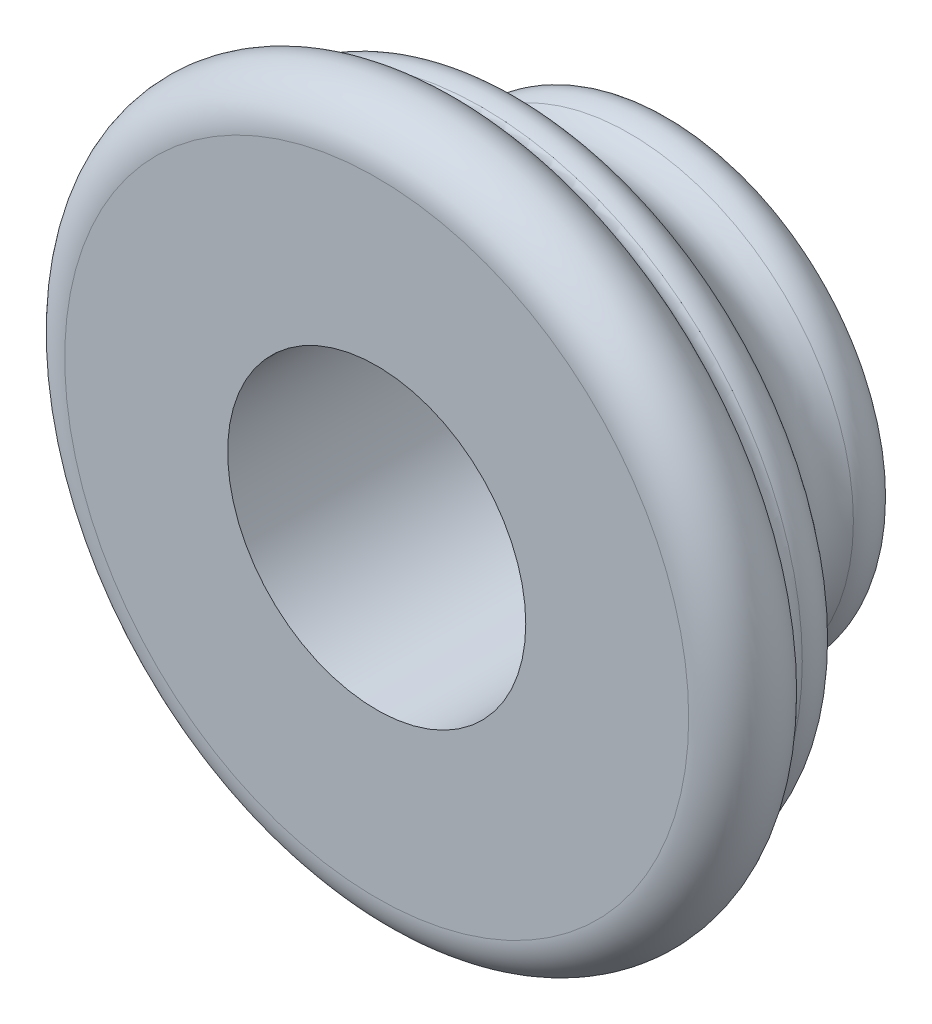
from build123d import *


with BuildPart() as part:
    # Sketch 1 → Revolve 1 (revolve)
    with BuildSketch(Plane(origin=(0, 0, 0), x_dir=(0, 0, -1), z_dir=(1, 0, 0)), mode=Mode.PRIVATE) as revolve_1_sk:
        with BuildLine():
            Line((0, 10.465), (0, 5))
            Line((0, 5), (10, 5))
            Line((10, 5), (10, 6.655))
            ThreePointArc((10, 6.655), (9.490113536, 7.526658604), (8.480422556, 7.509423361))
            add(Edge.make_bspline(
                [(8.480422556, 7.509423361), (7.174343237, 6.715192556), (6.210626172, 7.929562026), (4.765483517, 10.31771863)],
                knots=[0, 0, 0, 0, 1, 1, 1, 1], degree=3))
            ThreePointArc((4.765483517, 10.31771863), (4.23035658, 10.747274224), (3.544348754, 10.730778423))
            ThreePointArc((3.544348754, 10.730778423), (3.161730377, 10.737834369), (2.896167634, 11.013375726))
            ThreePointArc((2.896167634, 11.013375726), (1.220940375, 11.938813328), (0, 10.465))
        make_face()
    revolve(revolve_1_sk.sketch.rotate(Axis((0, 0, 7.079171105), (0, 0, -1)), 90), axis=Axis((0, 0, 7.079171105), (0, 0, -1)))


solid = part.part
